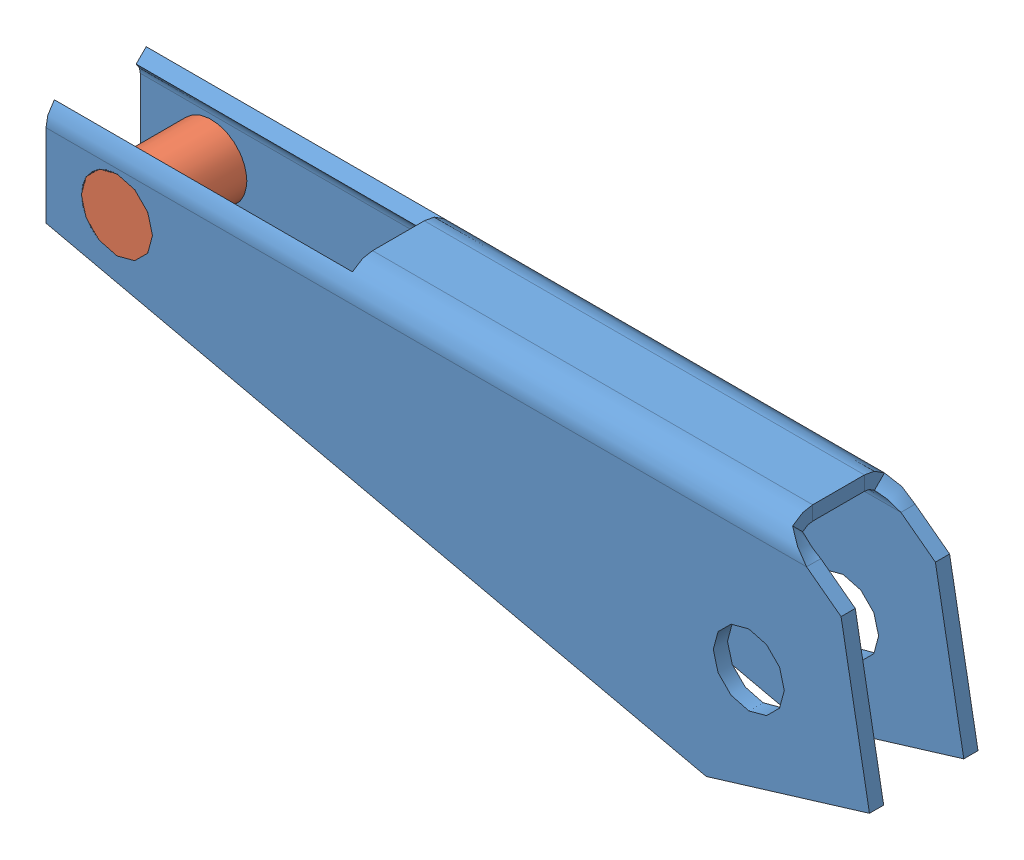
SolidWorks assembly S2.SLDASM, configuration Default (file format 3400). Lengths in mm.
Overall size (116 36.64 15.3).
2 component instances, 2 part files, 2 mates.
Components (placement in the parent):
- bras 3-1: bras 3.SLDPRT [Défaut] at origin size (116 36.64 15.3)
- axe galet 8-1: axe galet 8.SLDPRT [Défaut] at (-62 -47 -2.0024) size (10 10 15.29)
Mates (geometry in assembly coordinates):
- Coaxiale1: concentric aligned: cylinder of bras 3-1; cylinder of axe galet 8-1
- Coïncidente1: coincident aligned: plane of bras 3-1 through (-122 11 13.2876) normal (0 0 1); plane of axe galet 8-1 through (-112 3 13.2876) normal (0 0 1)
